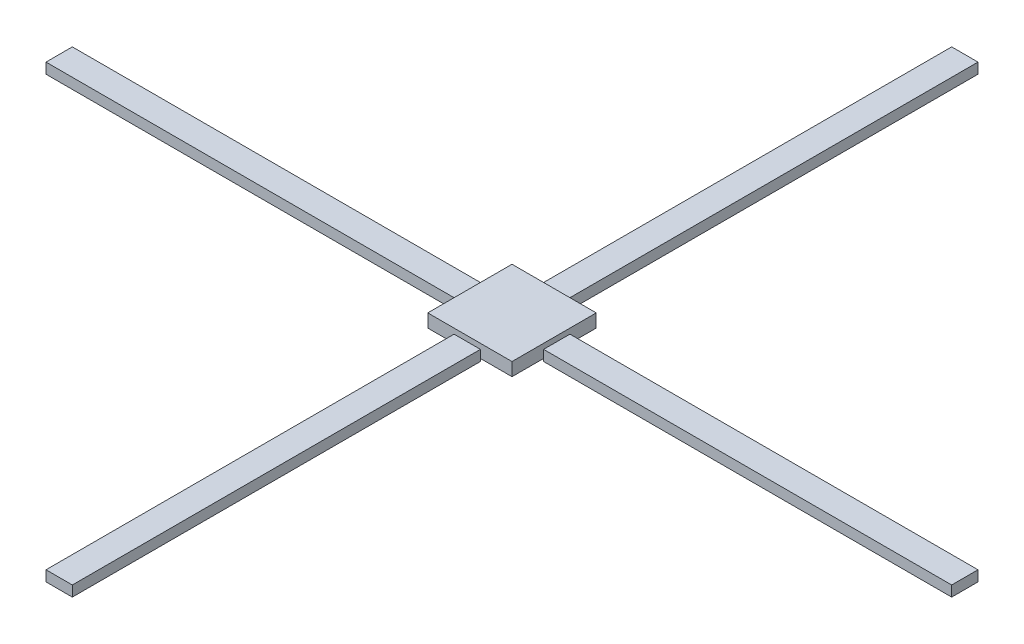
from build123d import *

# Parameters (mm, degrees)
SKETCH1_W             = 77500
SKETCH1_H             = 5000
BOSS_EXTRUDE1_DEPTH   = 2000
BOSS_EXTRUDE1_2_DEPTH = 2000
SKETCH1_W_2           = 5000
SKETCH1_H_2           = 77500
BOSS_EXTRUDE1_3_DEPTH = 2000
BOSS_EXTRUDE1_4_DEPTH = 2000
SKETCH2_W             = 16000
SKETCH2_H             = 16000
BOSS_EXTRUDE2_DEPTH   = 2500


with BuildPart() as part:
    # Sketch1 → Boss-Extrude1 (new body)
    with BuildSketch(Plane(origin=(0, 0, 0), x_dir=(1, 0, 0), z_dir=(0, 1, 0))):
        with Locations((47250, 0)):
            Rectangle(SKETCH1_W, SKETCH1_H)
    extrude(amount=BOSS_EXTRUDE1_DEPTH)


with BuildPart() as body_2:
    # Sketch1 → Boss-Extrude1 2 (new body)
    with BuildSketch(Plane(origin=(0, 0, 0), x_dir=(1, 0, 0), z_dir=(0, 1, 0))):
        with Locations((-47250, 0)):
            Rectangle(SKETCH1_W, SKETCH1_H)
    extrude(amount=BOSS_EXTRUDE1_2_DEPTH)


with BuildPart() as body_3:
    # Sketch1 → Boss-Extrude1 3 (new body)
    with BuildSketch(Plane(origin=(0, 0, 0), x_dir=(1, 0, 0), z_dir=(0, 1, 0))):
        with Locations((0, 47250)):
            Rectangle(SKETCH1_W_2, SKETCH1_H_2)
    extrude(amount=BOSS_EXTRUDE1_3_DEPTH)


with BuildPart() as body_4:
    # Sketch1 → Boss-Extrude1 4 (new body)
    with BuildSketch(Plane(origin=(0, 0, 0), x_dir=(1, 0, 0), z_dir=(0, 1, 0))):
        with Locations((0, -47250)):
            Rectangle(SKETCH1_W_2, SKETCH1_H_2)
    extrude(amount=BOSS_EXTRUDE1_4_DEPTH)


with BuildPart() as body_5:
    # Sketch2 → Boss-Extrude2 (new body)
    with BuildSketch(Plane(origin=(0, 0, 0), x_dir=(1, 0, 0), z_dir=(0, 1, 0))):
        Rectangle(SKETCH2_W, SKETCH2_H)
    extrude(amount=BOSS_EXTRUDE2_DEPTH)


solid = Compound([part.part, body_2.part, body_3.part, body_4.part, body_5.part])
